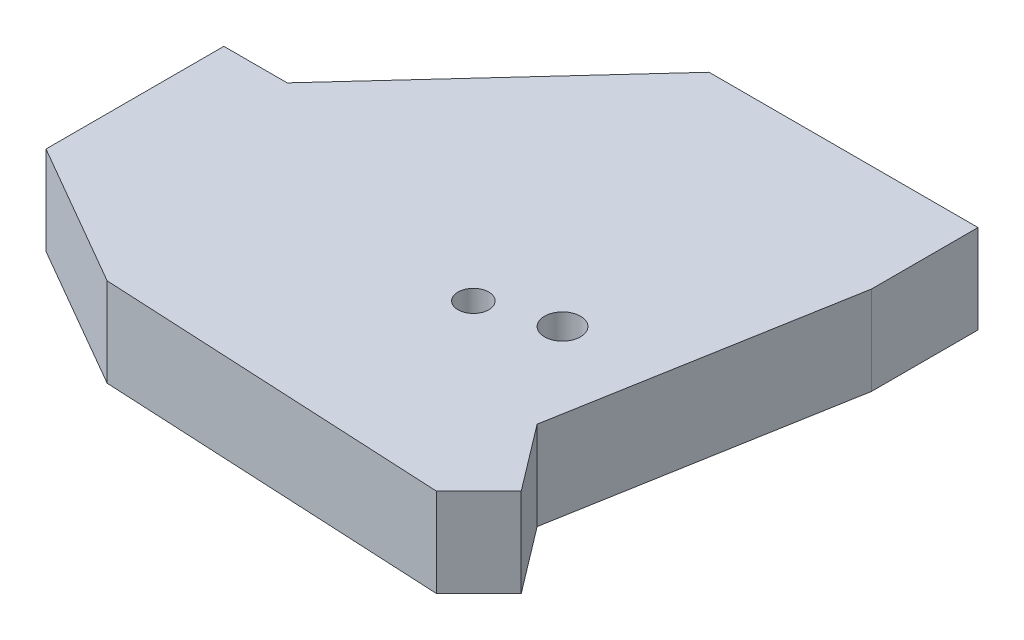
from build123d import *

# Parameters (mm, degrees)
SKETCH4_R      = 87.5
SKETCH4_R_2    = 75
EXTRUDE2_DEPTH = 432


with BuildPart() as part:
    # Sketch4 → Extrude2 (new body)
    with BuildSketch(Plane(origin=(0, 0, 0), x_dir=(1, 0, 0), z_dir=(0, 1, 0))):
        Polygon((0, 0), (0, 866.036269), (308.352807, 866.036269), (1290.517505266, 1937.880953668), (2599.999999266, 1937.880953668), (2599.999999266, 1419.359862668), (2355.951318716, 35.291017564), (2599.978893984, -286.203440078), (2394.04726686, -492.135067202), (704.633732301, -406.848681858), align=None)
        with Locations(Location((2005.999999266, 508.880953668, 0), (0, 0, 270))):
            Circle(SKETCH4_R, mode=Mode.SUBTRACT)
        with Locations(Location((1680.999999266, 399.880953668, 0), (0, 0, 270))):
            Circle(SKETCH4_R_2, mode=Mode.SUBTRACT)
    extrude(amount=EXTRUDE2_DEPTH)


solid = part.part
